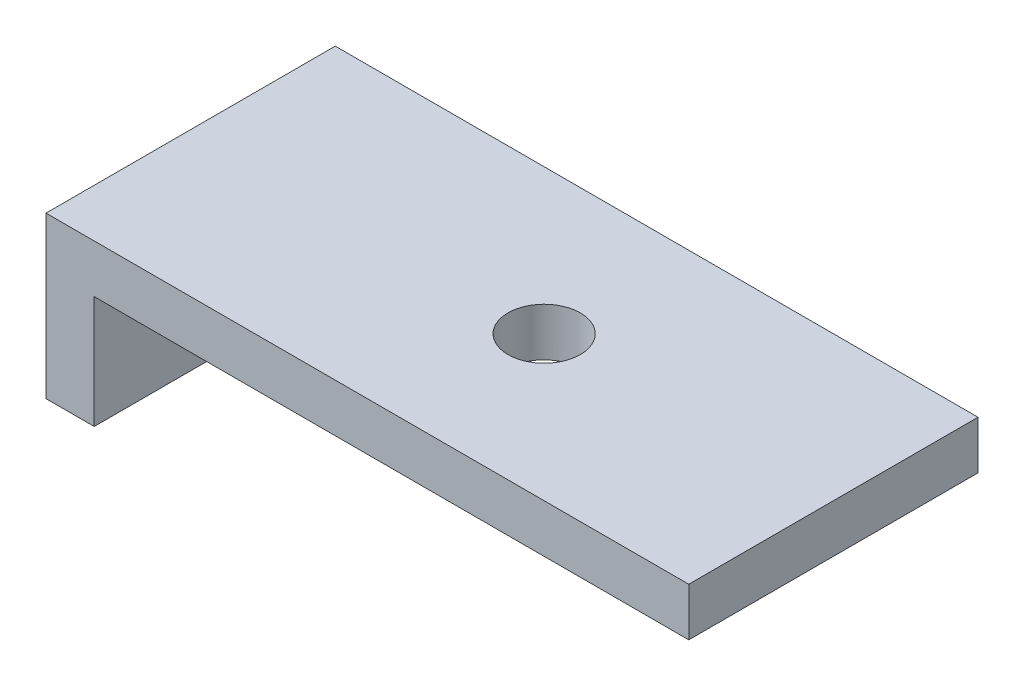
ISO-10303-21;
HEADER;
FILE_DESCRIPTION(('STEP AP214'),'2;1');
FILE_NAME('part.step','',(''),(''),'','','');
FILE_SCHEMA(('AUTOMOTIVE_DESIGN { 1 0 10303 214 1 1 1 1 }'));
ENDSEC;
DATA;
#1=APPLICATION_CONTEXT('core data for automotive mechanical design processes');
#2=APPLICATION_PROTOCOL_DEFINITION('international standard','automotive_design',2000,#1);
#3=PRODUCT_CONTEXT('',#1,'mechanical');
#4=PRODUCT('Part','Part','',(#3));
#5=PRODUCT_RELATED_PRODUCT_CATEGORY('part','',(#4));
#6=PRODUCT_DEFINITION_FORMATION('','',#4);
#7=PRODUCT_DEFINITION_CONTEXT('part definition',#1,'design');
#8=PRODUCT_DEFINITION('design','',#6,#7);
#9=PRODUCT_DEFINITION_SHAPE('','',#8);
#10=(LENGTH_UNIT() NAMED_UNIT(*) SI_UNIT(.MILLI.,.METRE.));
#11=(NAMED_UNIT(*) PLANE_ANGLE_UNIT() SI_UNIT($,.RADIAN.));
#12=(NAMED_UNIT(*) SI_UNIT($,.STERADIAN.) SOLID_ANGLE_UNIT());
#13=UNCERTAINTY_MEASURE_WITH_UNIT(LENGTH_MEASURE(1.E-05),#10,'distance_accuracy_value','');
#14=(GEOMETRIC_REPRESENTATION_CONTEXT(3) GLOBAL_UNCERTAINTY_ASSIGNED_CONTEXT((#13)) GLOBAL_UNIT_ASSIGNED_CONTEXT((#10,
#11,#12)) REPRESENTATION_CONTEXT('',''));
#15=CARTESIAN_POINT('',(0.,0.,0.));
#16=DIRECTION('',(0.,0.,1.));
#17=DIRECTION('',(1.,0.,0.));
#18=AXIS2_PLACEMENT_3D('',#15,#16,#17);
#19=CARTESIAN_POINT('',(0.,6.99999999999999,18.));
#20=DIRECTION('',(-1.,0.,0.));
#21=DIRECTION('',(0.,0.,1.));
#22=AXIS2_PLACEMENT_3D('',#19,#20,#21);
#23=PLANE('',#22);
#24=DIRECTION('',(0.,1.,0.));
#25=VECTOR('',#24,1.);
#26=CARTESIAN_POINT('',(0.,6.99999999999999,0.));
#27=LINE('',#26,#25);
#28=CARTESIAN_POINT('',(0.,0.,0.));
#29=VERTEX_POINT('',#28);
#30=CARTESIAN_POINT('',(0.,6.99999999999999,0.));
#31=VERTEX_POINT('',#30);
#32=EDGE_CURVE('E117',#29,#31,#27,.T.);
#33=ORIENTED_EDGE('',*,*,#32,.T.);
#34=DIRECTION('',(0.,0.,-1.));
#35=VECTOR('',#34,1.);
#36=CARTESIAN_POINT('',(0.,6.99999999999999,18.));
#37=LINE('',#36,#35);
#38=CARTESIAN_POINT('',(0.,6.99999999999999,18.));
#39=VERTEX_POINT('',#38);
#40=EDGE_CURVE('E11',#39,#31,#37,.T.);
#41=ORIENTED_EDGE('',*,*,#40,.F.);
#42=DIRECTION('',(0.,1.,0.));
#43=VECTOR('',#42,1.);
#44=CARTESIAN_POINT('',(0.,6.99999999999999,18.));
#45=LINE('',#44,#43);
#46=CARTESIAN_POINT('',(0.,0.,18.));
#47=VERTEX_POINT('',#46);
#48=EDGE_CURVE('E128',#47,#39,#45,.T.);
#49=ORIENTED_EDGE('',*,*,#48,.F.);
#50=DIRECTION('',(0.,0.,-1.));
#51=VECTOR('',#50,1.);
#52=CARTESIAN_POINT('',(0.,0.,18.));
#53=LINE('',#52,#51);
#54=EDGE_CURVE('E113',#47,#29,#53,.T.);
#55=ORIENTED_EDGE('',*,*,#54,.T.);
#56=EDGE_LOOP('',(#33,#41,#49,#55));
#57=FACE_BOUND('',#56,.T.);
#58=ADVANCED_FACE('F33',(#57),#23,.F.);
#59=CARTESIAN_POINT('',(37.,7.,18.));
#60=DIRECTION('',(0.,1.,0.));
#61=DIRECTION('',(-1.,0.,0.));
#62=AXIS2_PLACEMENT_3D('',#59,#60,#61);
#63=PLANE('',#62);
#64=CARTESIAN_POINT('',(19.,7.,9.));
#65=DIRECTION('',(0.,1.,0.));
#66=DIRECTION('',(-1.,0.,0.));
#67=AXIS2_PLACEMENT_3D('',#64,#65,#66);
#68=CIRCLE('',#67,2.25);
#69=CARTESIAN_POINT('',(16.75,7.,9.));
#70=VERTEX_POINT('',#69);
#71=EDGE_CURVE('E121',#70,#70,#68,.T.);
#72=ORIENTED_EDGE('',*,*,#71,.T.);
#73=EDGE_LOOP('',(#72));
#74=FACE_BOUND('',#73,.T.);
#75=DIRECTION('',(1.,0.,0.));
#76=VECTOR('',#75,1.);
#77=CARTESIAN_POINT('',(37.,7.,0.));
#78=LINE('',#77,#76);
#79=CARTESIAN_POINT('',(37.,7.,0.));
#80=VERTEX_POINT('',#79);
#81=EDGE_CURVE('E120',#31,#80,#78,.T.);
#82=ORIENTED_EDGE('',*,*,#81,.T.);
#83=DIRECTION('',(0.,0.,-1.));
#84=VECTOR('',#83,1.);
#85=CARTESIAN_POINT('',(37.,7.,18.));
#86=LINE('',#85,#84);
#87=CARTESIAN_POINT('',(37.,7.,18.));
#88=VERTEX_POINT('',#87);
#89=EDGE_CURVE('E41',#88,#80,#86,.T.);
#90=ORIENTED_EDGE('',*,*,#89,.F.);
#91=DIRECTION('',(1.,0.,0.));
#92=VECTOR('',#91,1.);
#93=CARTESIAN_POINT('',(37.,7.,18.));
#94=LINE('',#93,#92);
#95=EDGE_CURVE('E86',#39,#88,#94,.T.);
#96=ORIENTED_EDGE('',*,*,#95,.F.);
#97=ORIENTED_EDGE('',*,*,#40,.T.);
#98=EDGE_LOOP('',(#82,#90,#96,#97));
#99=FACE_BOUND('',#98,.T.);
#100=ADVANCED_FACE('F152',(#74,#99),#63,.F.);
#101=CARTESIAN_POINT('',(37.,10.,18.));
#102=DIRECTION('',(-1.,0.,0.));
#103=DIRECTION('',(0.,-1.,0.));
#104=AXIS2_PLACEMENT_3D('',#101,#102,#103);
#105=PLANE('',#104);
#106=DIRECTION('',(0.,1.,0.));
#107=VECTOR('',#106,1.);
#108=CARTESIAN_POINT('',(37.,10.,0.));
#109=LINE('',#108,#107);
#110=CARTESIAN_POINT('',(37.,10.,0.));
#111=VERTEX_POINT('',#110);
#112=EDGE_CURVE('E123',#80,#111,#109,.T.);
#113=ORIENTED_EDGE('',*,*,#112,.T.);
#114=DIRECTION('',(0.,0.,-1.));
#115=VECTOR('',#114,1.);
#116=CARTESIAN_POINT('',(37.,10.,18.));
#117=LINE('',#116,#115);
#118=CARTESIAN_POINT('',(37.,10.,18.));
#119=VERTEX_POINT('',#118);
#120=EDGE_CURVE('E108',#119,#111,#117,.T.);
#121=ORIENTED_EDGE('',*,*,#120,.F.);
#122=DIRECTION('',(0.,1.,0.));
#123=VECTOR('',#122,1.);
#124=CARTESIAN_POINT('',(37.,10.,18.));
#125=LINE('',#124,#123);
#126=EDGE_CURVE('E99',#88,#119,#125,.T.);
#127=ORIENTED_EDGE('',*,*,#126,.F.);
#128=ORIENTED_EDGE('',*,*,#89,.T.);
#129=EDGE_LOOP('',(#113,#121,#127,#128));
#130=FACE_BOUND('',#129,.T.);
#131=ADVANCED_FACE('F134',(#130),#105,.F.);
#132=CARTESIAN_POINT('',(-3.,10.,18.));
#133=DIRECTION('',(0.,-1.,0.));
#134=DIRECTION('',(0.,0.,-1.));
#135=AXIS2_PLACEMENT_3D('',#132,#133,#134);
#136=PLANE('',#135);
#137=CARTESIAN_POINT('',(19.,10.,9.));
#138=DIRECTION('',(0.,1.,0.));
#139=DIRECTION('',(0.,0.,1.));
#140=AXIS2_PLACEMENT_3D('',#137,#138,#139);
#141=CIRCLE('',#140,2.25);
#142=CARTESIAN_POINT('',(19.,10.,11.25));
#143=VERTEX_POINT('',#142);
#144=EDGE_CURVE('E169',#143,#143,#141,.T.);
#145=ORIENTED_EDGE('',*,*,#144,.F.);
#146=EDGE_LOOP('',(#145));
#147=FACE_BOUND('',#146,.T.);
#148=DIRECTION('',(-1.,0.,0.));
#149=VECTOR('',#148,1.);
#150=CARTESIAN_POINT('',(-3.,10.,0.));
#151=LINE('',#150,#149);
#152=CARTESIAN_POINT('',(-3.,10.,0.));
#153=VERTEX_POINT('',#152);
#154=EDGE_CURVE('E107',#111,#153,#151,.T.);
#155=ORIENTED_EDGE('',*,*,#154,.T.);
#156=DIRECTION('',(0.,0.,-1.));
#157=VECTOR('',#156,1.);
#158=CARTESIAN_POINT('',(-3.,10.,18.));
#159=LINE('',#158,#157);
#160=CARTESIAN_POINT('',(-3.,10.,18.));
#161=VERTEX_POINT('',#160);
#162=EDGE_CURVE('E104',#161,#153,#159,.T.);
#163=ORIENTED_EDGE('',*,*,#162,.F.);
#164=DIRECTION('',(-1.,0.,0.));
#165=VECTOR('',#164,1.);
#166=CARTESIAN_POINT('',(-3.,10.,18.));
#167=LINE('',#166,#165);
#168=EDGE_CURVE('E93',#119,#161,#167,.T.);
#169=ORIENTED_EDGE('',*,*,#168,.F.);
#170=ORIENTED_EDGE('',*,*,#120,.T.);
#171=EDGE_LOOP('',(#155,#163,#169,#170));
#172=FACE_BOUND('',#171,.T.);
#173=ADVANCED_FACE('F105',(#147,#172),#136,.F.);
#174=CARTESIAN_POINT('',(-3.,0.,18.));
#175=DIRECTION('',(1.,0.,0.));
#176=DIRECTION('',(0.,0.,-1.));
#177=AXIS2_PLACEMENT_3D('',#174,#175,#176);
#178=PLANE('',#177);
#179=DIRECTION('',(0.,-1.,0.));
#180=VECTOR('',#179,1.);
#181=CARTESIAN_POINT('',(-3.,0.,0.));
#182=LINE('',#181,#180);
#183=CARTESIAN_POINT('',(-3.,0.,0.));
#184=VERTEX_POINT('',#183);
#185=EDGE_CURVE('E72',#153,#184,#182,.T.);
#186=ORIENTED_EDGE('',*,*,#185,.T.);
#187=DIRECTION('',(0.,0.,-1.));
#188=VECTOR('',#187,1.);
#189=CARTESIAN_POINT('',(-3.,0.,18.));
#190=LINE('',#189,#188);
#191=CARTESIAN_POINT('',(-3.,0.,18.));
#192=VERTEX_POINT('',#191);
#193=EDGE_CURVE('E109',#192,#184,#190,.T.);
#194=ORIENTED_EDGE('',*,*,#193,.F.);
#195=DIRECTION('',(0.,-1.,0.));
#196=VECTOR('',#195,1.);
#197=CARTESIAN_POINT('',(-3.,0.,18.));
#198=LINE('',#197,#196);
#199=EDGE_CURVE('E97',#161,#192,#198,.T.);
#200=ORIENTED_EDGE('',*,*,#199,.F.);
#201=ORIENTED_EDGE('',*,*,#162,.T.);
#202=EDGE_LOOP('',(#186,#194,#200,#201));
#203=FACE_BOUND('',#202,.T.);
#204=ADVANCED_FACE('F111',(#203),#178,.F.);
#205=CARTESIAN_POINT('',(0.,0.,18.));
#206=DIRECTION('',(0.,1.,0.));
#207=DIRECTION('',(-1.,0.,0.));
#208=AXIS2_PLACEMENT_3D('',#205,#206,#207);
#209=PLANE('',#208);
#210=DIRECTION('',(1.,0.,0.));
#211=VECTOR('',#210,1.);
#212=CARTESIAN_POINT('',(0.,0.,0.));
#213=LINE('',#212,#211);
#214=EDGE_CURVE('E78',#184,#29,#213,.T.);
#215=ORIENTED_EDGE('',*,*,#214,.T.);
#216=ORIENTED_EDGE('',*,*,#54,.F.);
#217=DIRECTION('',(1.,0.,0.));
#218=VECTOR('',#217,1.);
#219=CARTESIAN_POINT('',(0.,0.,18.));
#220=LINE('',#219,#218);
#221=EDGE_CURVE('E49',#192,#47,#220,.T.);
#222=ORIENTED_EDGE('',*,*,#221,.F.);
#223=ORIENTED_EDGE('',*,*,#193,.T.);
#224=EDGE_LOOP('',(#215,#216,#222,#223));
#225=FACE_BOUND('',#224,.T.);
#226=ADVANCED_FACE('F141',(#225),#209,.F.);
#227=CARTESIAN_POINT('',(0.,0.,18.));
#228=DIRECTION('',(0.,0.,-1.));
#229=DIRECTION('',(-1.,0.,0.));
#230=AXIS2_PLACEMENT_3D('',#227,#228,#229);
#231=PLANE('',#230);
#232=ORIENTED_EDGE('',*,*,#48,.T.);
#233=ORIENTED_EDGE('',*,*,#95,.T.);
#234=ORIENTED_EDGE('',*,*,#126,.T.);
#235=ORIENTED_EDGE('',*,*,#168,.T.);
#236=ORIENTED_EDGE('',*,*,#199,.T.);
#237=ORIENTED_EDGE('',*,*,#221,.T.);
#238=EDGE_LOOP('',(#232,#233,#234,#235,#236,#237));
#239=FACE_BOUND('',#238,.T.);
#240=ADVANCED_FACE('F95',(#239),#231,.F.);
#241=CARTESIAN_POINT('',(0.,0.,0.));
#242=DIRECTION('',(0.,0.,-1.));
#243=DIRECTION('',(-1.,0.,0.));
#244=AXIS2_PLACEMENT_3D('',#241,#242,#243);
#245=PLANE('',#244);
#246=ORIENTED_EDGE('',*,*,#32,.F.);
#247=ORIENTED_EDGE('',*,*,#214,.F.);
#248=ORIENTED_EDGE('',*,*,#185,.F.);
#249=ORIENTED_EDGE('',*,*,#154,.F.);
#250=ORIENTED_EDGE('',*,*,#112,.F.);
#251=ORIENTED_EDGE('',*,*,#81,.F.);
#252=EDGE_LOOP('',(#246,#247,#248,#249,#250,#251));
#253=FACE_BOUND('',#252,.T.);
#254=ADVANCED_FACE('F137',(#253),#245,.T.);
#255=CARTESIAN_POINT('',(19.,0.,9.));
#256=DIRECTION('',(0.,1.,0.));
#257=DIRECTION('',(0.,0.,1.));
#258=AXIS2_PLACEMENT_3D('',#255,#256,#257);
#259=CYLINDRICAL_SURFACE('',#258,2.25);
#260=ORIENTED_EDGE('',*,*,#144,.T.);
#261=EDGE_LOOP('',(#260));
#262=FACE_BOUND('',#261,.T.);
#263=ORIENTED_EDGE('',*,*,#71,.F.);
#264=EDGE_LOOP('',(#263));
#265=FACE_BOUND('',#264,.T.);
#266=ADVANCED_FACE('F177',(#262,#265),#259,.F.);
#267=CLOSED_SHELL('',(#58,#100,#131,#173,#204,#226,#240,#254,#266));
#268=MANIFOLD_SOLID_BREP('B2',#267);
#269=ADVANCED_BREP_SHAPE_REPRESENTATION('',(#18,#268),#14);
#270=SHAPE_DEFINITION_REPRESENTATION(#9,#269);
ENDSEC;
END-ISO-10303-21;
